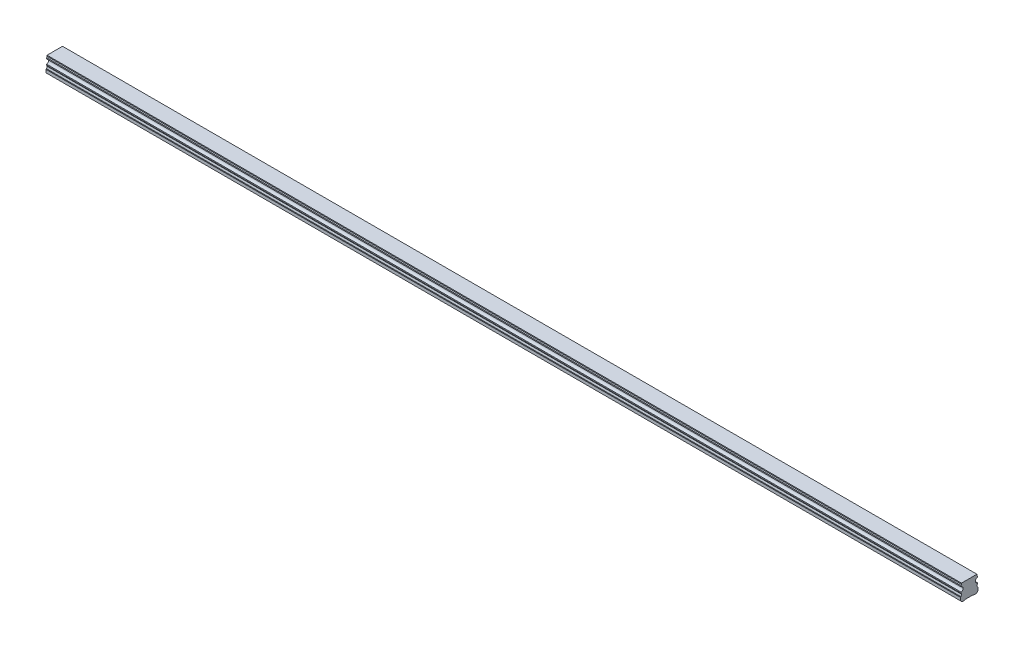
from build123d import *

# Parameters (mm, degrees)
BOSS_EXTRUDE1_DEPTH        = 780
SKETCH3_R                  = 2.5
SKETCH3_R_2                = 2.1
CUT_EXTRUDE3_DEPTH         = 7
SKETCH3_2_R                = 2.1
CUT_EXTRUDE4_DEPTH         = 9.5
CHAMFER1_SIZE              = 0.4
LPATTERN2_COUNT            = 13
LPATTERN2_PITCH            = 60
CHAMFER1_OF_LPATTERN2_SIZE = 0.4


with BuildPart() as part:
    # Sketch1 → Boss-Extrude1 (new body)
    with BuildSketch(Plane(origin=(0, 0, 0), x_dir=(0, 0, -1), z_dir=(1, 0, 0))):
        with BuildLine():
            Line((6.59, 14), (-6.59, 14))
            Line((-6.59, 14), (-6.59, 13.15))
            Line((-6.59, 13.15), (-6.96, 12.356532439))
            Line((-6.96, 12.356532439), (-6.96, 11.435174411))
            ThreePointArc((-6.96, 11.435174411), (-5.25, 9.5), (-6.96, 7.564825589))
            Line((-6.96, 7.564825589), (-6.96, 6.643467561))
            Line((-6.96, 6.643467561), (-6.59, 5.85))
            Line((-6.59, 5.85), (-7.032116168, 4.2))
            Line((-7.032116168, 4.2), (-7.5, 3.929867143))
            Line((-7.5, 3.929867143), (-7.5, 1.4))
            Line((-7.5, 1.4), (-6.1, 0))
            Line((-6.1, 0), (-3.65, 0))
            Line((-3.65, 0), (-3.25, 0.4))
            Line((-3.25, 0.4), (3.25, 0.4))
            Line((3.25, 0.4), (3.65, 0))
            Line((3.65, 0), (6.1, 0))
            Line((6.1, 0), (7.5, 1.4))
            Line((7.5, 1.4), (7.5, 3.929867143))
            Line((7.5, 3.929867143), (7.032116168, 4.2))
            Line((7.032116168, 4.2), (6.59, 5.85))
            Line((6.59, 5.85), (6.96, 6.643467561))
            Line((6.96, 6.643467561), (6.96, 7.564825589))
            ThreePointArc((6.96, 7.564825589), (5.25, 9.5), (6.96, 11.435174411))
            Line((6.96, 11.435174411), (6.96, 12.356532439))
            Line((6.96, 12.356532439), (6.59, 13.15))
            Line((6.59, 13.15), (6.59, 14))
        make_face()
    extrude(amount=BOSS_EXTRUDE1_DEPTH)

    # Sketch3 → Cut-Extrude3 (cut)
    with BuildSketch(Plane.XZ):
        with Locations(Location((30, 0, 0), (0, 0, 270))):
            Circle(SKETCH3_R)
        with Locations(Location((30, 0, 0), (0, 0, 270))):
            Circle(SKETCH3_R_2, mode=Mode.SUBTRACT)
    cut_extrude3 = extrude(amount=-CUT_EXTRUDE3_DEPTH, mode=Mode.SUBTRACT)

    # Sketch3_2 → Cut-Extrude4 (cut)
    with BuildSketch(Plane.XZ):
        with Locations(Location((30, 0, 0), (0, 0, 270))):
            Circle(SKETCH3_2_R)
    cut_extrude4 = extrude(amount=-CUT_EXTRUDE4_DEPTH, mode=Mode.SUBTRACT)

    # Cut-Extrude5 cone 1 section (on through the dimple's axis) → Cut-Extrude5 (revolve, cut)
    with BuildSketch(Plane(origin=(30, 9.5, 0), x_dir=(0, 0, -1), z_dir=(1, 0, 0))):
        Polygon((0, 0), (2.1, 0), (0, 1.212435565), align=None)
    revolve(axis=Axis((30, 9.5, 0), (0, 1, 0)), mode=Mode.SUBTRACT)

    # Chamfer1
    chamfer1_edges = [part.edges().sort_by_distance(p)[0] for p in [
        (30, 0.4, 2.5),
    ]]
    chamfer(chamfer1_edges, length=CHAMFER1_SIZE)

    # LPattern2: Cut-Extrude3, Cut-Extrude4 ×13
    with Locations(*[(i * LPATTERN2_PITCH, 0, 0) for i in range(1, LPATTERN2_COUNT)]):
        add(cut_extrude3, mode=Mode.SUBTRACT)
        add(cut_extrude4, mode=Mode.SUBTRACT)

    # Chamfer1 of LPattern2
    chamfer1_of_lpattern2_edges = [part.edges().sort_by_distance(p)[0] for p in [
        (90, 0.4, 2.5),
        (150, 0.4, 2.5),
        (210, 0.4, 2.5),
        (270, 0.4, 2.5),
        (330, 0.4, 2.5),
        (390, 0.4, 2.5),
        (450, 0.4, 2.5),
        (510, 0.4, 2.5),
        (570, 0.4, 2.5),
        (630, 0.4, 2.5),
        (690, 0.4, 2.5),
        (750, 0.4, 2.5),
    ]]
    chamfer(chamfer1_of_lpattern2_edges, length=CHAMFER1_OF_LPATTERN2_SIZE)


solid = part.part
